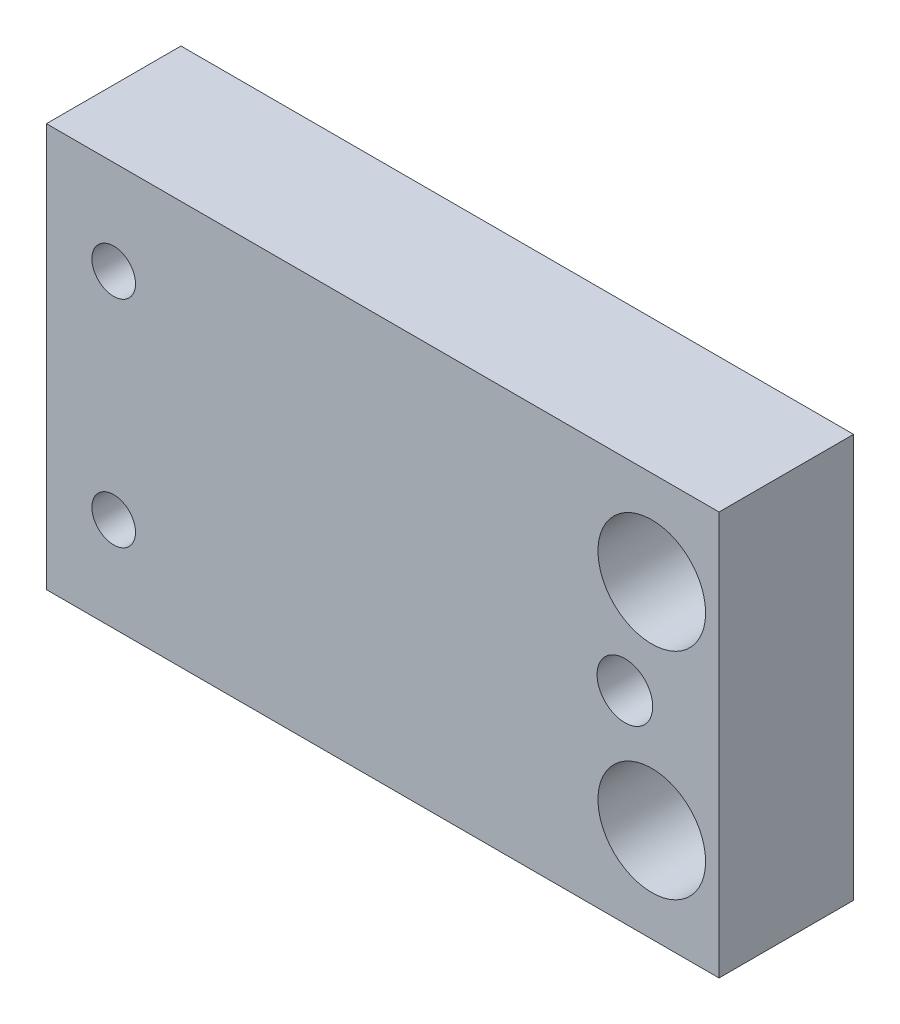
ISO-10303-21;
HEADER;
FILE_DESCRIPTION(('STEP AP214'),'2;1');
FILE_NAME('part.step','',(''),(''),'','','');
FILE_SCHEMA(('AUTOMOTIVE_DESIGN { 1 0 10303 214 1 1 1 1 }'));
ENDSEC;
DATA;
#1=APPLICATION_CONTEXT('core data for automotive mechanical design processes');
#2=APPLICATION_PROTOCOL_DEFINITION('international standard','automotive_design',2000,#1);
#3=PRODUCT_CONTEXT('',#1,'mechanical');
#4=PRODUCT('Part','Part','',(#3));
#5=PRODUCT_RELATED_PRODUCT_CATEGORY('part','',(#4));
#6=PRODUCT_DEFINITION_FORMATION('','',#4);
#7=PRODUCT_DEFINITION_CONTEXT('part definition',#1,'design');
#8=PRODUCT_DEFINITION('design','',#6,#7);
#9=PRODUCT_DEFINITION_SHAPE('','',#8);
#10=(LENGTH_UNIT() NAMED_UNIT(*) SI_UNIT(.MILLI.,.METRE.));
#11=(NAMED_UNIT(*) PLANE_ANGLE_UNIT() SI_UNIT($,.RADIAN.));
#12=(NAMED_UNIT(*) SI_UNIT($,.STERADIAN.) SOLID_ANGLE_UNIT());
#13=UNCERTAINTY_MEASURE_WITH_UNIT(LENGTH_MEASURE(1.E-05),#10,'distance_accuracy_value','');
#14=(GEOMETRIC_REPRESENTATION_CONTEXT(3) GLOBAL_UNCERTAINTY_ASSIGNED_CONTEXT((#13)) GLOBAL_UNIT_ASSIGNED_CONTEXT((#10,
#11,#12)) REPRESENTATION_CONTEXT('',''));
#15=CARTESIAN_POINT('',(0.,0.,0.));
#16=DIRECTION('',(0.,0.,1.));
#17=DIRECTION('',(1.,0.,0.));
#18=AXIS2_PLACEMENT_3D('',#15,#16,#17);
#19=CARTESIAN_POINT('',(-25.,15.,10.));
#20=DIRECTION('',(0.,0.,1.));
#21=DIRECTION('',(1.,0.,0.));
#22=AXIS2_PLACEMENT_3D('',#19,#20,#21);
#23=PLANE('',#22);
#24=CARTESIAN_POINT('',(20.,8.,10.));
#25=DIRECTION('',(0.,0.,1.));
#26=DIRECTION('',(1.,0.,0.));
#27=AXIS2_PLACEMENT_3D('',#24,#25,#26);
#28=CIRCLE('',#27,4.);
#29=CARTESIAN_POINT('',(24.,8.,10.));
#30=VERTEX_POINT('',#29);
#31=EDGE_CURVE('E127',#30,#30,#28,.T.);
#32=ORIENTED_EDGE('',*,*,#31,.F.);
#33=EDGE_LOOP('',(#32));
#34=FACE_BOUND('',#33,.T.);
#35=CARTESIAN_POINT('',(-20.,8.,10.));
#36=DIRECTION('',(0.,0.,1.));
#37=DIRECTION('',(1.,0.,0.));
#38=AXIS2_PLACEMENT_3D('',#35,#36,#37);
#39=CIRCLE('',#38,1.621);
#40=CARTESIAN_POINT('',(-18.379,8.,10.));
#41=VERTEX_POINT('',#40);
#42=EDGE_CURVE('E115',#41,#41,#39,.T.);
#43=ORIENTED_EDGE('',*,*,#42,.F.);
#44=EDGE_LOOP('',(#43));
#45=FACE_BOUND('',#44,.T.);
#46=DIRECTION('',(-1.,0.,0.));
#47=VECTOR('',#46,1.);
#48=CARTESIAN_POINT('',(25.,15.,10.));
#49=LINE('',#48,#47);
#50=CARTESIAN_POINT('',(25.,15.,10.));
#51=VERTEX_POINT('',#50);
#52=CARTESIAN_POINT('',(-25.,15.,10.));
#53=VERTEX_POINT('',#52);
#54=EDGE_CURVE('E83',#51,#53,#49,.T.);
#55=ORIENTED_EDGE('',*,*,#54,.T.);
#56=DIRECTION('',(0.,-1.,0.));
#57=VECTOR('',#56,1.);
#58=CARTESIAN_POINT('',(-25.,15.,10.));
#59=LINE('',#58,#57);
#60=CARTESIAN_POINT('',(-25.,-15.,10.));
#61=VERTEX_POINT('',#60);
#62=EDGE_CURVE('E78',#53,#61,#59,.T.);
#63=ORIENTED_EDGE('',*,*,#62,.T.);
#64=DIRECTION('',(1.,0.,0.));
#65=VECTOR('',#64,1.);
#66=CARTESIAN_POINT('',(-25.,-15.,10.));
#67=LINE('',#66,#65);
#68=CARTESIAN_POINT('',(25.,-15.,10.));
#69=VERTEX_POINT('',#68);
#70=EDGE_CURVE('E81',#61,#69,#67,.T.);
#71=ORIENTED_EDGE('',*,*,#70,.T.);
#72=DIRECTION('',(0.,1.,0.));
#73=VECTOR('',#72,1.);
#74=CARTESIAN_POINT('',(25.,-15.,10.));
#75=LINE('',#74,#73);
#76=EDGE_CURVE('E48',#69,#51,#75,.T.);
#77=ORIENTED_EDGE('',*,*,#76,.T.);
#78=EDGE_LOOP('',(#55,#63,#71,#77));
#79=FACE_BOUND('',#78,.T.);
#80=CARTESIAN_POINT('',(18.,0.,10.));
#81=DIRECTION('',(0.,0.,-1.));
#82=DIRECTION('',(-1.,0.,0.));
#83=AXIS2_PLACEMENT_3D('',#80,#81,#82);
#84=CIRCLE('',#83,2.067);
#85=CARTESIAN_POINT('',(15.933,0.,10.));
#86=VERTEX_POINT('',#85);
#87=EDGE_CURVE('E112',#86,#86,#84,.T.);
#88=ORIENTED_EDGE('',*,*,#87,.T.);
#89=EDGE_LOOP('',(#88));
#90=FACE_BOUND('',#89,.T.);
#91=CARTESIAN_POINT('',(-20.,-8.,10.));
#92=DIRECTION('',(0.,0.,1.));
#93=DIRECTION('',(1.,0.,0.));
#94=AXIS2_PLACEMENT_3D('',#91,#92,#93);
#95=CIRCLE('',#94,1.621);
#96=CARTESIAN_POINT('',(-18.379,-8.,10.));
#97=VERTEX_POINT('',#96);
#98=EDGE_CURVE('E121',#97,#97,#95,.T.);
#99=ORIENTED_EDGE('',*,*,#98,.F.);
#100=EDGE_LOOP('',(#99));
#101=FACE_BOUND('',#100,.T.);
#102=CARTESIAN_POINT('',(20.,-8.,10.));
#103=DIRECTION('',(0.,0.,1.));
#104=DIRECTION('',(1.,0.,0.));
#105=AXIS2_PLACEMENT_3D('',#102,#103,#104);
#106=CIRCLE('',#105,4.);
#107=CARTESIAN_POINT('',(24.,-8.,10.));
#108=VERTEX_POINT('',#107);
#109=EDGE_CURVE('E131',#108,#108,#106,.T.);
#110=ORIENTED_EDGE('',*,*,#109,.F.);
#111=EDGE_LOOP('',(#110));
#112=FACE_BOUND('',#111,.T.);
#113=ADVANCED_FACE('F31',(#34,#45,#79,#90,#101,#112),#23,.T.);
#114=CARTESIAN_POINT('',(-25.,15.,0.));
#115=DIRECTION('',(0.,0.,1.));
#116=DIRECTION('',(1.,0.,0.));
#117=AXIS2_PLACEMENT_3D('',#114,#115,#116);
#118=PLANE('',#117);
#119=CARTESIAN_POINT('',(20.,8.,0.));
#120=DIRECTION('',(0.,0.,1.));
#121=DIRECTION('',(1.,0.,0.));
#122=AXIS2_PLACEMENT_3D('',#119,#120,#121);
#123=CIRCLE('',#122,4.);
#124=CARTESIAN_POINT('',(24.,8.,0.));
#125=VERTEX_POINT('',#124);
#126=EDGE_CURVE('E128',#125,#125,#123,.T.);
#127=ORIENTED_EDGE('',*,*,#126,.T.);
#128=EDGE_LOOP('',(#127));
#129=FACE_BOUND('',#128,.T.);
#130=CARTESIAN_POINT('',(-20.,8.,0.));
#131=DIRECTION('',(0.,0.,1.));
#132=DIRECTION('',(1.,0.,0.));
#133=AXIS2_PLACEMENT_3D('',#130,#131,#132);
#134=CIRCLE('',#133,1.621);
#135=CARTESIAN_POINT('',(-18.379,8.,0.));
#136=VERTEX_POINT('',#135);
#137=EDGE_CURVE('E118',#136,#136,#134,.T.);
#138=ORIENTED_EDGE('',*,*,#137,.T.);
#139=EDGE_LOOP('',(#138));
#140=FACE_BOUND('',#139,.T.);
#141=DIRECTION('',(-1.,0.,0.));
#142=VECTOR('',#141,1.);
#143=CARTESIAN_POINT('',(25.,15.,0.));
#144=LINE('',#143,#142);
#145=CARTESIAN_POINT('',(25.,15.,0.));
#146=VERTEX_POINT('',#145);
#147=CARTESIAN_POINT('',(-25.,15.,0.));
#148=VERTEX_POINT('',#147);
#149=EDGE_CURVE('E95',#146,#148,#144,.T.);
#150=ORIENTED_EDGE('',*,*,#149,.F.);
#151=DIRECTION('',(0.,1.,0.));
#152=VECTOR('',#151,1.);
#153=CARTESIAN_POINT('',(25.,-15.,0.));
#154=LINE('',#153,#152);
#155=CARTESIAN_POINT('',(25.,-15.,0.));
#156=VERTEX_POINT('',#155);
#157=EDGE_CURVE('E71',#156,#146,#154,.T.);
#158=ORIENTED_EDGE('',*,*,#157,.F.);
#159=DIRECTION('',(1.,0.,0.));
#160=VECTOR('',#159,1.);
#161=CARTESIAN_POINT('',(-25.,-15.,0.));
#162=LINE('',#161,#160);
#163=CARTESIAN_POINT('',(-25.,-15.,0.));
#164=VERTEX_POINT('',#163);
#165=EDGE_CURVE('E65',#164,#156,#162,.T.);
#166=ORIENTED_EDGE('',*,*,#165,.F.);
#167=DIRECTION('',(0.,-1.,0.));
#168=VECTOR('',#167,1.);
#169=CARTESIAN_POINT('',(-25.,15.,0.));
#170=LINE('',#169,#168);
#171=EDGE_CURVE('E87',#148,#164,#170,.T.);
#172=ORIENTED_EDGE('',*,*,#171,.F.);
#173=EDGE_LOOP('',(#150,#158,#166,#172));
#174=FACE_BOUND('',#173,.T.);
#175=CARTESIAN_POINT('',(18.,0.,0.));
#176=DIRECTION('',(0.,0.,-1.));
#177=DIRECTION('',(-1.,0.,0.));
#178=AXIS2_PLACEMENT_3D('',#175,#176,#177);
#179=CIRCLE('',#178,2.067);
#180=CARTESIAN_POINT('',(15.933,0.,0.));
#181=VERTEX_POINT('',#180);
#182=EDGE_CURVE('E98',#181,#181,#179,.T.);
#183=ORIENTED_EDGE('',*,*,#182,.F.);
#184=EDGE_LOOP('',(#183));
#185=FACE_BOUND('',#184,.T.);
#186=CARTESIAN_POINT('',(-20.,-8.,0.));
#187=DIRECTION('',(0.,0.,1.));
#188=DIRECTION('',(1.,0.,0.));
#189=AXIS2_PLACEMENT_3D('',#186,#187,#188);
#190=CIRCLE('',#189,1.621);
#191=CARTESIAN_POINT('',(-18.379,-8.,0.));
#192=VERTEX_POINT('',#191);
#193=EDGE_CURVE('E124',#192,#192,#190,.T.);
#194=ORIENTED_EDGE('',*,*,#193,.T.);
#195=EDGE_LOOP('',(#194));
#196=FACE_BOUND('',#195,.T.);
#197=CARTESIAN_POINT('',(20.,-8.,0.));
#198=DIRECTION('',(0.,0.,1.));
#199=DIRECTION('',(1.,0.,0.));
#200=AXIS2_PLACEMENT_3D('',#197,#198,#199);
#201=CIRCLE('',#200,4.);
#202=CARTESIAN_POINT('',(24.,-8.,0.));
#203=VERTEX_POINT('',#202);
#204=EDGE_CURVE('E134',#203,#203,#201,.T.);
#205=ORIENTED_EDGE('',*,*,#204,.T.);
#206=EDGE_LOOP('',(#205));
#207=FACE_BOUND('',#206,.T.);
#208=ADVANCED_FACE('F106',(#129,#140,#174,#185,#196,#207),#118,.F.);
#209=CARTESIAN_POINT('',(25.,15.,10.));
#210=DIRECTION('',(0.,-1.,0.));
#211=DIRECTION('',(0.,0.,-1.));
#212=AXIS2_PLACEMENT_3D('',#209,#210,#211);
#213=PLANE('',#212);
#214=ORIENTED_EDGE('',*,*,#149,.T.);
#215=DIRECTION('',(0.,0.,-1.));
#216=VECTOR('',#215,1.);
#217=CARTESIAN_POINT('',(-25.,15.,10.));
#218=LINE('',#217,#216);
#219=EDGE_CURVE('E11',#53,#148,#218,.T.);
#220=ORIENTED_EDGE('',*,*,#219,.F.);
#221=ORIENTED_EDGE('',*,*,#54,.F.);
#222=DIRECTION('',(0.,0.,-1.));
#223=VECTOR('',#222,1.);
#224=CARTESIAN_POINT('',(25.,15.,10.));
#225=LINE('',#224,#223);
#226=EDGE_CURVE('E91',#51,#146,#225,.T.);
#227=ORIENTED_EDGE('',*,*,#226,.T.);
#228=EDGE_LOOP('',(#214,#220,#221,#227));
#229=FACE_BOUND('',#228,.T.);
#230=ADVANCED_FACE('F33',(#229),#213,.F.);
#231=CARTESIAN_POINT('',(-25.,15.,10.));
#232=DIRECTION('',(1.,0.,0.));
#233=DIRECTION('',(0.,0.,-1.));
#234=AXIS2_PLACEMENT_3D('',#231,#232,#233);
#235=PLANE('',#234);
#236=ORIENTED_EDGE('',*,*,#171,.T.);
#237=DIRECTION('',(0.,0.,-1.));
#238=VECTOR('',#237,1.);
#239=CARTESIAN_POINT('',(-25.,-15.,10.));
#240=LINE('',#239,#238);
#241=EDGE_CURVE('E40',#61,#164,#240,.T.);
#242=ORIENTED_EDGE('',*,*,#241,.F.);
#243=ORIENTED_EDGE('',*,*,#62,.F.);
#244=ORIENTED_EDGE('',*,*,#219,.T.);
#245=EDGE_LOOP('',(#236,#242,#243,#244));
#246=FACE_BOUND('',#245,.T.);
#247=ADVANCED_FACE('F86',(#246),#235,.F.);
#248=CARTESIAN_POINT('',(-25.,-15.,10.));
#249=DIRECTION('',(0.,1.,0.));
#250=DIRECTION('',(0.,0.,1.));
#251=AXIS2_PLACEMENT_3D('',#248,#249,#250);
#252=PLANE('',#251);
#253=ORIENTED_EDGE('',*,*,#165,.T.);
#254=DIRECTION('',(0.,0.,-1.));
#255=VECTOR('',#254,1.);
#256=CARTESIAN_POINT('',(25.,-15.,10.));
#257=LINE('',#256,#255);
#258=EDGE_CURVE('E88',#69,#156,#257,.T.);
#259=ORIENTED_EDGE('',*,*,#258,.F.);
#260=ORIENTED_EDGE('',*,*,#70,.F.);
#261=ORIENTED_EDGE('',*,*,#241,.T.);
#262=EDGE_LOOP('',(#253,#259,#260,#261));
#263=FACE_BOUND('',#262,.T.);
#264=ADVANCED_FACE('F89',(#263),#252,.F.);
#265=CARTESIAN_POINT('',(25.,-15.,10.));
#266=DIRECTION('',(-1.,0.,0.));
#267=DIRECTION('',(0.,0.,1.));
#268=AXIS2_PLACEMENT_3D('',#265,#266,#267);
#269=PLANE('',#268);
#270=ORIENTED_EDGE('',*,*,#157,.T.);
#271=ORIENTED_EDGE('',*,*,#226,.F.);
#272=ORIENTED_EDGE('',*,*,#76,.F.);
#273=ORIENTED_EDGE('',*,*,#258,.T.);
#274=EDGE_LOOP('',(#270,#271,#272,#273));
#275=FACE_BOUND('',#274,.T.);
#276=ADVANCED_FACE('F103',(#275),#269,.F.);
#277=CARTESIAN_POINT('',(18.,0.,10.));
#278=DIRECTION('',(0.,0.,-1.));
#279=DIRECTION('',(-1.,0.,0.));
#280=AXIS2_PLACEMENT_3D('',#277,#278,#279);
#281=CYLINDRICAL_SURFACE('',#280,2.067);
#282=ORIENTED_EDGE('',*,*,#182,.T.);
#283=EDGE_LOOP('',(#282));
#284=FACE_BOUND('',#283,.T.);
#285=ORIENTED_EDGE('',*,*,#87,.F.);
#286=EDGE_LOOP('',(#285));
#287=FACE_BOUND('',#286,.T.);
#288=ADVANCED_FACE('F154',(#284,#287),#281,.F.);
#289=CARTESIAN_POINT('',(-20.,8.,0.));
#290=DIRECTION('',(0.,0.,1.));
#291=DIRECTION('',(1.,0.,0.));
#292=AXIS2_PLACEMENT_3D('',#289,#290,#291);
#293=CYLINDRICAL_SURFACE('',#292,1.621);
#294=ORIENTED_EDGE('',*,*,#42,.T.);
#295=EDGE_LOOP('',(#294));
#296=FACE_BOUND('',#295,.T.);
#297=ORIENTED_EDGE('',*,*,#137,.F.);
#298=EDGE_LOOP('',(#297));
#299=FACE_BOUND('',#298,.T.);
#300=ADVANCED_FACE('F197',(#296,#299),#293,.F.);
#301=CARTESIAN_POINT('',(-20.,-8.,0.));
#302=DIRECTION('',(0.,0.,1.));
#303=DIRECTION('',(1.,0.,0.));
#304=AXIS2_PLACEMENT_3D('',#301,#302,#303);
#305=CYLINDRICAL_SURFACE('',#304,1.621);
#306=ORIENTED_EDGE('',*,*,#98,.T.);
#307=EDGE_LOOP('',(#306));
#308=FACE_BOUND('',#307,.T.);
#309=ORIENTED_EDGE('',*,*,#193,.F.);
#310=EDGE_LOOP('',(#309));
#311=FACE_BOUND('',#310,.T.);
#312=ADVANCED_FACE('F190',(#308,#311),#305,.F.);
#313=CARTESIAN_POINT('',(20.,8.,10.));
#314=DIRECTION('',(0.,0.,-1.));
#315=DIRECTION('',(-1.,0.,0.));
#316=AXIS2_PLACEMENT_3D('',#313,#314,#315);
#317=CYLINDRICAL_SURFACE('',#316,4.);
#318=ORIENTED_EDGE('',*,*,#31,.T.);
#319=EDGE_LOOP('',(#318));
#320=FACE_BOUND('',#319,.T.);
#321=ORIENTED_EDGE('',*,*,#126,.F.);
#322=EDGE_LOOP('',(#321));
#323=FACE_BOUND('',#322,.T.);
#324=ADVANCED_FACE('F182',(#320,#323),#317,.F.);
#325=CARTESIAN_POINT('',(20.,-8.,10.));
#326=DIRECTION('',(0.,0.,-1.));
#327=DIRECTION('',(-1.,0.,0.));
#328=AXIS2_PLACEMENT_3D('',#325,#326,#327);
#329=CYLINDRICAL_SURFACE('',#328,4.);
#330=ORIENTED_EDGE('',*,*,#109,.T.);
#331=EDGE_LOOP('',(#330));
#332=FACE_BOUND('',#331,.T.);
#333=ORIENTED_EDGE('',*,*,#204,.F.);
#334=EDGE_LOOP('',(#333));
#335=FACE_BOUND('',#334,.T.);
#336=ADVANCED_FACE('F140',(#332,#335),#329,.F.);
#337=CLOSED_SHELL('',(#113,#208,#230,#247,#264,#276,#288,#300,#312,#324,#336));
#338=MANIFOLD_SOLID_BREP('B2',#337);
#339=ADVANCED_BREP_SHAPE_REPRESENTATION('',(#18,#338),#14);
#340=SHAPE_DEFINITION_REPRESENTATION(#9,#339);
ENDSEC;
END-ISO-10303-21;
